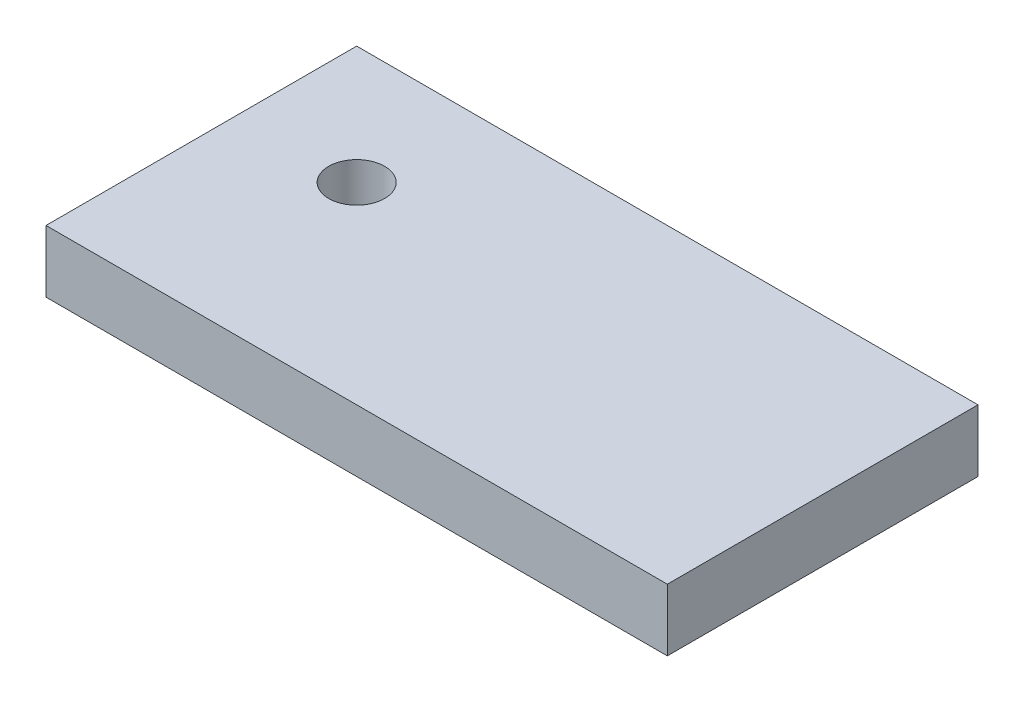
ISO-10303-21;
HEADER;
FILE_DESCRIPTION(('STEP AP214'),'2;1');
FILE_NAME('part.step','',(''),(''),'','','');
FILE_SCHEMA(('AUTOMOTIVE_DESIGN { 1 0 10303 214 1 1 1 1 }'));
ENDSEC;
DATA;
#1=APPLICATION_CONTEXT('core data for automotive mechanical design processes');
#2=APPLICATION_PROTOCOL_DEFINITION('international standard','automotive_design',2000,#1);
#3=PRODUCT_CONTEXT('',#1,'mechanical');
#4=PRODUCT('Part','Part','',(#3));
#5=PRODUCT_RELATED_PRODUCT_CATEGORY('part','',(#4));
#6=PRODUCT_DEFINITION_FORMATION('','',#4);
#7=PRODUCT_DEFINITION_CONTEXT('part definition',#1,'design');
#8=PRODUCT_DEFINITION('design','',#6,#7);
#9=PRODUCT_DEFINITION_SHAPE('','',#8);
#10=(LENGTH_UNIT() NAMED_UNIT(*) SI_UNIT(.MILLI.,.METRE.));
#11=(NAMED_UNIT(*) PLANE_ANGLE_UNIT() SI_UNIT($,.RADIAN.));
#12=(NAMED_UNIT(*) SI_UNIT($,.STERADIAN.) SOLID_ANGLE_UNIT());
#13=UNCERTAINTY_MEASURE_WITH_UNIT(LENGTH_MEASURE(1.E-05),#10,'distance_accuracy_value','');
#14=(GEOMETRIC_REPRESENTATION_CONTEXT(3) GLOBAL_UNCERTAINTY_ASSIGNED_CONTEXT((#13)) GLOBAL_UNIT_ASSIGNED_CONTEXT((#10,
#11,#12)) REPRESENTATION_CONTEXT('',''));
#15=CARTESIAN_POINT('',(0.,0.,0.));
#16=DIRECTION('',(0.,0.,1.));
#17=DIRECTION('',(1.,0.,0.));
#18=AXIS2_PLACEMENT_3D('',#15,#16,#17);
#19=CARTESIAN_POINT('',(0.,10.,0.));
#20=DIRECTION('',(1.,0.,0.));
#21=DIRECTION('',(0.,0.,-1.));
#22=AXIS2_PLACEMENT_3D('',#19,#20,#21);
#23=PLANE('',#22);
#24=DIRECTION('',(0.,0.,1.));
#25=VECTOR('',#24,1.);
#26=CARTESIAN_POINT('',(0.,0.,0.));
#27=LINE('',#26,#25);
#28=CARTESIAN_POINT('',(0.,0.,-50.));
#29=VERTEX_POINT('',#28);
#30=CARTESIAN_POINT('',(0.,0.,0.));
#31=VERTEX_POINT('',#30);
#32=EDGE_CURVE('E93',#29,#31,#27,.T.);
#33=ORIENTED_EDGE('',*,*,#32,.T.);
#34=DIRECTION('',(0.,-1.,0.));
#35=VECTOR('',#34,1.);
#36=CARTESIAN_POINT('',(0.,10.,0.));
#37=LINE('',#36,#35);
#38=CARTESIAN_POINT('',(0.,10.,0.));
#39=VERTEX_POINT('',#38);
#40=EDGE_CURVE('E11',#39,#31,#37,.T.);
#41=ORIENTED_EDGE('',*,*,#40,.F.);
#42=DIRECTION('',(0.,0.,1.));
#43=VECTOR('',#42,1.);
#44=CARTESIAN_POINT('',(0.,10.,0.));
#45=LINE('',#44,#43);
#46=CARTESIAN_POINT('',(0.,10.,-50.));
#47=VERTEX_POINT('',#46);
#48=EDGE_CURVE('E81',#47,#39,#45,.T.);
#49=ORIENTED_EDGE('',*,*,#48,.F.);
#50=DIRECTION('',(0.,-1.,0.));
#51=VECTOR('',#50,1.);
#52=CARTESIAN_POINT('',(0.,10.,-50.));
#53=LINE('',#52,#51);
#54=EDGE_CURVE('E89',#47,#29,#53,.T.);
#55=ORIENTED_EDGE('',*,*,#54,.T.);
#56=EDGE_LOOP('',(#33,#41,#49,#55));
#57=FACE_BOUND('',#56,.T.);
#58=ADVANCED_FACE('F30',(#57),#23,.F.);
#59=CARTESIAN_POINT('',(0.,10.,0.));
#60=DIRECTION('',(0.,0.,-1.));
#61=DIRECTION('',(-1.,0.,0.));
#62=AXIS2_PLACEMENT_3D('',#59,#60,#61);
#63=PLANE('',#62);
#64=DIRECTION('',(1.,0.,0.));
#65=VECTOR('',#64,1.);
#66=CARTESIAN_POINT('',(0.,0.,0.));
#67=LINE('',#66,#65);
#68=CARTESIAN_POINT('',(100.,0.,0.));
#69=VERTEX_POINT('',#68);
#70=EDGE_CURVE('E85',#31,#69,#67,.T.);
#71=ORIENTED_EDGE('',*,*,#70,.T.);
#72=DIRECTION('',(0.,-1.,0.));
#73=VECTOR('',#72,1.);
#74=CARTESIAN_POINT('',(100.,10.,0.));
#75=LINE('',#74,#73);
#76=CARTESIAN_POINT('',(100.,10.,0.));
#77=VERTEX_POINT('',#76);
#78=EDGE_CURVE('E38',#77,#69,#75,.T.);
#79=ORIENTED_EDGE('',*,*,#78,.F.);
#80=DIRECTION('',(1.,0.,0.));
#81=VECTOR('',#80,1.);
#82=CARTESIAN_POINT('',(0.,10.,0.));
#83=LINE('',#82,#81);
#84=EDGE_CURVE('E76',#39,#77,#83,.T.);
#85=ORIENTED_EDGE('',*,*,#84,.F.);
#86=ORIENTED_EDGE('',*,*,#40,.T.);
#87=EDGE_LOOP('',(#71,#79,#85,#86));
#88=FACE_BOUND('',#87,.T.);
#89=ADVANCED_FACE('F84',(#88),#63,.F.);
#90=CARTESIAN_POINT('',(100.,10.,0.));
#91=DIRECTION('',(-1.,0.,0.));
#92=DIRECTION('',(0.,0.,1.));
#93=AXIS2_PLACEMENT_3D('',#90,#91,#92);
#94=PLANE('',#93);
#95=DIRECTION('',(0.,0.,-1.));
#96=VECTOR('',#95,1.);
#97=CARTESIAN_POINT('',(100.,0.,0.));
#98=LINE('',#97,#96);
#99=CARTESIAN_POINT('',(100.,0.,-50.));
#100=VERTEX_POINT('',#99);
#101=EDGE_CURVE('E63',#69,#100,#98,.T.);
#102=ORIENTED_EDGE('',*,*,#101,.T.);
#103=DIRECTION('',(0.,-1.,0.));
#104=VECTOR('',#103,1.);
#105=CARTESIAN_POINT('',(100.,10.,-50.));
#106=LINE('',#105,#104);
#107=CARTESIAN_POINT('',(100.,10.,-50.));
#108=VERTEX_POINT('',#107);
#109=EDGE_CURVE('E86',#108,#100,#106,.T.);
#110=ORIENTED_EDGE('',*,*,#109,.F.);
#111=DIRECTION('',(0.,0.,-1.));
#112=VECTOR('',#111,1.);
#113=CARTESIAN_POINT('',(100.,10.,0.));
#114=LINE('',#113,#112);
#115=EDGE_CURVE('E79',#77,#108,#114,.T.);
#116=ORIENTED_EDGE('',*,*,#115,.F.);
#117=ORIENTED_EDGE('',*,*,#78,.T.);
#118=EDGE_LOOP('',(#102,#110,#116,#117));
#119=FACE_BOUND('',#118,.T.);
#120=ADVANCED_FACE('F87',(#119),#94,.F.);
#121=CARTESIAN_POINT('',(0.,10.,-50.));
#122=DIRECTION('',(0.,0.,1.));
#123=DIRECTION('',(1.,0.,0.));
#124=AXIS2_PLACEMENT_3D('',#121,#122,#123);
#125=PLANE('',#124);
#126=DIRECTION('',(-1.,0.,0.));
#127=VECTOR('',#126,1.);
#128=CARTESIAN_POINT('',(0.,0.,-50.));
#129=LINE('',#128,#127);
#130=EDGE_CURVE('E69',#100,#29,#129,.T.);
#131=ORIENTED_EDGE('',*,*,#130,.T.);
#132=ORIENTED_EDGE('',*,*,#54,.F.);
#133=DIRECTION('',(-1.,0.,0.));
#134=VECTOR('',#133,1.);
#135=CARTESIAN_POINT('',(0.,10.,-50.));
#136=LINE('',#135,#134);
#137=EDGE_CURVE('E46',#108,#47,#136,.T.);
#138=ORIENTED_EDGE('',*,*,#137,.F.);
#139=ORIENTED_EDGE('',*,*,#109,.T.);
#140=EDGE_LOOP('',(#131,#132,#138,#139));
#141=FACE_BOUND('',#140,.T.);
#142=ADVANCED_FACE('F101',(#141),#125,.F.);
#143=CARTESIAN_POINT('',(0.,10.,-50.));
#144=DIRECTION('',(0.,-1.,0.));
#145=DIRECTION('',(0.,0.,-1.));
#146=AXIS2_PLACEMENT_3D('',#143,#144,#145);
#147=PLANE('',#146);
#148=CARTESIAN_POINT('',(19.,10.,-31.));
#149=DIRECTION('',(0.,1.,0.));
#150=DIRECTION('',(0.,0.,1.));
#151=AXIS2_PLACEMENT_3D('',#148,#149,#150);
#152=CIRCLE('',#151,4.5);
#153=CARTESIAN_POINT('',(19.,10.,-26.5));
#154=VERTEX_POINT('',#153);
#155=EDGE_CURVE('E109',#154,#154,#152,.T.);
#156=ORIENTED_EDGE('',*,*,#155,.F.);
#157=EDGE_LOOP('',(#156));
#158=FACE_BOUND('',#157,.T.);
#159=ORIENTED_EDGE('',*,*,#48,.T.);
#160=ORIENTED_EDGE('',*,*,#84,.T.);
#161=ORIENTED_EDGE('',*,*,#115,.T.);
#162=ORIENTED_EDGE('',*,*,#137,.T.);
#163=EDGE_LOOP('',(#159,#160,#161,#162));
#164=FACE_BOUND('',#163,.T.);
#165=ADVANCED_FACE('F77',(#158,#164),#147,.F.);
#166=CARTESIAN_POINT('',(0.,0.,-50.));
#167=DIRECTION('',(0.,-1.,0.));
#168=DIRECTION('',(0.,0.,-1.));
#169=AXIS2_PLACEMENT_3D('',#166,#167,#168);
#170=PLANE('',#169);
#171=CARTESIAN_POINT('',(19.,0.,-31.));
#172=DIRECTION('',(0.,1.,0.));
#173=DIRECTION('',(0.,0.,1.));
#174=AXIS2_PLACEMENT_3D('',#171,#172,#173);
#175=CIRCLE('',#174,4.5);
#176=CARTESIAN_POINT('',(19.,0.,-26.5));
#177=VERTEX_POINT('',#176);
#178=EDGE_CURVE('E96',#177,#177,#175,.T.);
#179=ORIENTED_EDGE('',*,*,#178,.T.);
#180=EDGE_LOOP('',(#179));
#181=FACE_BOUND('',#180,.T.);
#182=ORIENTED_EDGE('',*,*,#32,.F.);
#183=ORIENTED_EDGE('',*,*,#130,.F.);
#184=ORIENTED_EDGE('',*,*,#101,.F.);
#185=ORIENTED_EDGE('',*,*,#70,.F.);
#186=EDGE_LOOP('',(#182,#183,#184,#185));
#187=FACE_BOUND('',#186,.T.);
#188=ADVANCED_FACE('F104',(#181,#187),#170,.T.);
#189=CARTESIAN_POINT('',(19.,10.,-31.));
#190=DIRECTION('',(0.,1.,0.));
#191=DIRECTION('',(0.,0.,1.));
#192=AXIS2_PLACEMENT_3D('',#189,#190,#191);
#193=CYLINDRICAL_SURFACE('',#192,4.5);
#194=ORIENTED_EDGE('',*,*,#178,.F.);
#195=EDGE_LOOP('',(#194));
#196=FACE_BOUND('',#195,.T.);
#197=ORIENTED_EDGE('',*,*,#155,.T.);
#198=EDGE_LOOP('',(#197));
#199=FACE_BOUND('',#198,.T.);
#200=ADVANCED_FACE('F113',(#196,#199),#193,.F.);
#201=CLOSED_SHELL('',(#58,#89,#120,#142,#165,#188,#200));
#202=MANIFOLD_SOLID_BREP('B2',#201);
#203=ADVANCED_BREP_SHAPE_REPRESENTATION('',(#18,#202),#14);
#204=SHAPE_DEFINITION_REPRESENTATION(#9,#203);
ENDSEC;
END-ISO-10303-21;
